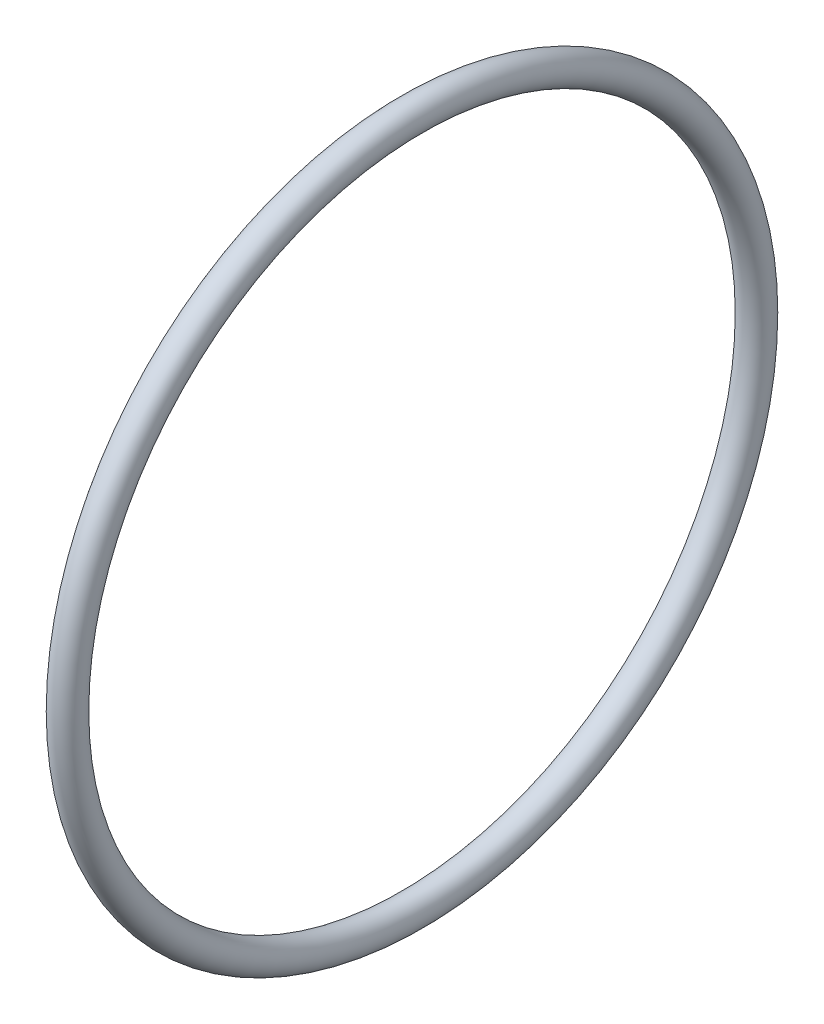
ISO-10303-21;
HEADER;
FILE_DESCRIPTION(('STEP AP214'),'2;1');
FILE_NAME('part.step','',(''),(''),'','','');
FILE_SCHEMA(('AUTOMOTIVE_DESIGN { 1 0 10303 214 1 1 1 1 }'));
ENDSEC;
DATA;
#1=APPLICATION_CONTEXT('core data for automotive mechanical design processes');
#2=APPLICATION_PROTOCOL_DEFINITION('international standard','automotive_design',2000,#1);
#3=PRODUCT_CONTEXT('',#1,'mechanical');
#4=PRODUCT('Part','Part','',(#3));
#5=PRODUCT_RELATED_PRODUCT_CATEGORY('part','',(#4));
#6=PRODUCT_DEFINITION_FORMATION('','',#4);
#7=PRODUCT_DEFINITION_CONTEXT('part definition',#1,'design');
#8=PRODUCT_DEFINITION('design','',#6,#7);
#9=PRODUCT_DEFINITION_SHAPE('','',#8);
#10=(LENGTH_UNIT() NAMED_UNIT(*) SI_UNIT(.MILLI.,.METRE.));
#11=(NAMED_UNIT(*) PLANE_ANGLE_UNIT() SI_UNIT($,.RADIAN.));
#12=(NAMED_UNIT(*) SI_UNIT($,.STERADIAN.) SOLID_ANGLE_UNIT());
#13=UNCERTAINTY_MEASURE_WITH_UNIT(LENGTH_MEASURE(1.E-05),#10,'distance_accuracy_value','');
#14=(GEOMETRIC_REPRESENTATION_CONTEXT(3) GLOBAL_UNCERTAINTY_ASSIGNED_CONTEXT((#13)) GLOBAL_UNIT_ASSIGNED_CONTEXT((#10,
#11,#12)) REPRESENTATION_CONTEXT('',''));
#15=CARTESIAN_POINT('',(0.,0.,0.));
#16=DIRECTION('',(0.,0.,1.));
#17=DIRECTION('',(1.,0.,0.));
#18=AXIS2_PLACEMENT_3D('',#15,#16,#17);
#19=CARTESIAN_POINT('',(-5.2526032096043,-5.15349748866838,0.));
#20=DIRECTION('',(-1.,0.,0.));
#21=DIRECTION('',(0.,0.,1.));
#22=AXIS2_PLACEMENT_3D('',#19,#20,#21);
#23=TOROIDAL_SURFACE('',#22,80.,3.495);
#24=CARTESIAN_POINT('',(-5.2526032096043,-5.15349748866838,83.495));
#25=VERTEX_POINT('',#24);
#26=VERTEX_LOOP('',#25);
#27=FACE_BOUND('',#26,.T.);
#28=ADVANCED_FACE('F27',(#27),#23,.T.);
#29=CLOSED_SHELL('',(#28));
#30=MANIFOLD_SOLID_BREP('B2',#29);
#31=ADVANCED_BREP_SHAPE_REPRESENTATION('',(#18,#30),#14);
#32=SHAPE_DEFINITION_REPRESENTATION(#9,#31);
ENDSEC;
END-ISO-10303-21;
